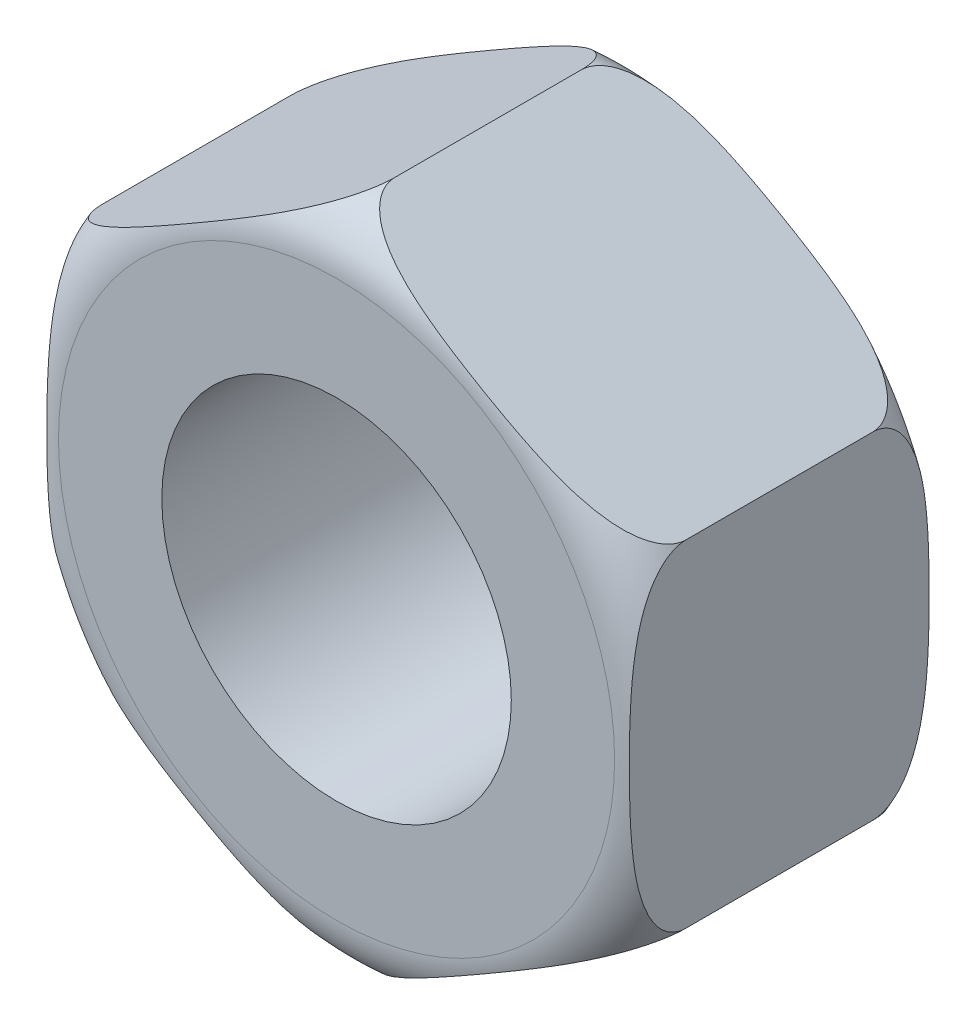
from build123d import *

# Parameters (mm, degrees)
HEAD_DEPTH         = 5.2
HOLE_SKETCH_R      = 3
THROUGH_HOLE_DEPTH = 10.23976929


with BuildPart() as part:
    # Head Sketch → Head (new body)
    with BuildSketch(Plane.XY):
        Polygon((0, 5.773502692), (5, 2.886751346), (5, -2.886751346), (0, -5.773502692), (-5, -2.886751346), (-5, 2.886751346), align=None)
    extrude(amount=HEAD_DEPTH)

    # Sketch5 → Head Trim (revolve, cut)
    with BuildSketch(Plane(origin=(0, 0, 0), x_dir=(0, 0, -1), z_dir=(1, 0, 0)), mode=Mode.PRIVATE) as head_trim_sk:
        with BuildLine():
            Line((-5.2, -4.773502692), (-5.2, -5.773502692))
            Line((-5.2, -5.773502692), (-4.2, -5.773502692))
            ThreePointArc((-4.2, -5.773502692), (-4.907106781, -5.480609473), (-5.2, -4.773502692))
        make_face()
    head_trim = revolve(head_trim_sk.sketch.rotate(Axis((0, 0, 15.085599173), (0, 0, -1)), 270), axis=Axis((0, 0, 15.085599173), (0, 0, -1)), mode=Mode.SUBTRACT)

    # Hole Sketch → Through Hole (cut, through all)
    with BuildSketch(Plane.XY.offset(5.2)):
        Circle(HOLE_SKETCH_R)
    extrude(amount=-THROUGH_HOLE_DEPTH, mode=Mode.SUBTRACT)

    # Sym_trie2: Head Trim across plane
    add(head_trim.mirror(Plane.XY.offset(2.6)), mode=Mode.SUBTRACT)


solid = part.part
